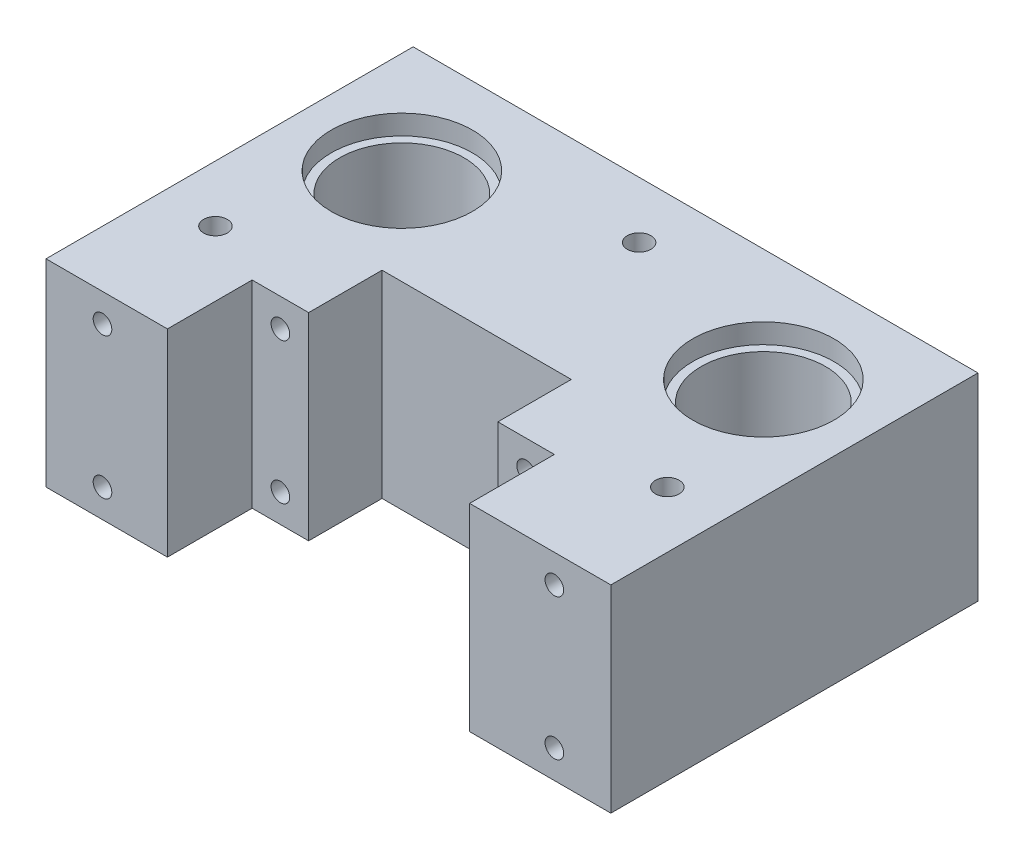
from build123d import *

# Parameters (mm, degrees)
SKETCH_1_W          = 100
SKETCH_1_H          = 35
EXTRUDE_1_DEPTH     = 65
SKETCH_2_OUTSIDE_W  = 126.86
SKETCH_2_OUTSIDE_H  = 91.86
SKETCH_2_OUTSIDE_R  = 11
CUT_EXTRUDE_1_DEPTH = 65
SKETCH_3_R          = 12.5
CUT_EXTRUDE_2_DEPTH = 3.5
SKETCH_4_R          = 2.1
CUT_EXTRUDE_3_DEPTH = 15
SKETCH_5_R          = 1.65
CUT_EXTRUDE_4_DEPTH = 15
SKETCH_6_R          = 1.65
CUT_EXTRUDE_5_DEPTH = 15
SKETCH_8_R          = 1.65
CUT_EXTRUDE_6_DEPTH = 15


with BuildPart() as part:
    # Sketch 1 → Extrude 1 (new body)
    with BuildSketch(Plane.XY):
        with Locations((50, 17.5)):
            Rectangle(SKETCH_1_W, SKETCH_1_H)
    extrude(amount=EXTRUDE_1_DEPTH)

    # Sketch 2 outside → Cut-Extrude 1 (cut)
    # profile 1 of 3: a face of its own
    with BuildSketch(Plane(origin=(0, 35, 0), x_dir=(1, 0, 0), z_dir=(0, 1, 0))):
        with Locations((50, -32.5)):
            Rectangle(SKETCH_2_OUTSIDE_W, SKETCH_2_OUTSIDE_H)
        Polygon((0, 0), (100, 0), (100, -65), (74.9975, -65), (74.9975, -50), (64.9975, -50), (64.9975, -37), (31.4975, -37), (31.4975, -50), (21.4975, -50), (21.4975, -65), (0, -65), align=None, mode=Mode.SUBTRACT)
    # profile 2 of 3: a face of its own
    with BuildSketch(Plane(origin=(0, 35, 0), x_dir=(1, 0, 0), z_dir=(0, 1, 0))):
        with Locations(Location((18, -20, 0), (0, 0, 270))):
            Circle(SKETCH_2_OUTSIDE_R)
    # profile 3 of 3: a face of its own
    with BuildSketch(Plane(origin=(0, 35, 0), x_dir=(1, 0, 0), z_dir=(0, 1, 0))):
        with Locations(Location((82, -20, 0), (0, 0, 270))):
            Circle(SKETCH_2_OUTSIDE_R)
    extrude(amount=-CUT_EXTRUDE_1_DEPTH, mode=Mode.SUBTRACT)

    # Sketch 3 → Cut-Extrude 2 (cut)
    with BuildSketch(Plane(origin=(0, 35, 0), x_dir=(1, 0, 0), z_dir=(0, 1, 0))):
        with Locations(Location((18, -20, 0), (0, 0, 270))):
            Circle(SKETCH_3_R)
        with Locations(Location((82, -20, 0), (0, 0, 270))):
            Circle(SKETCH_3_R)
    extrude(amount=-CUT_EXTRUDE_2_DEPTH, mode=Mode.SUBTRACT)

    # Sketch 4 → Cut-Extrude 3 (cut)
    with BuildSketch(Plane(origin=(0, 35, 0), x_dir=(1, 0, 0), z_dir=(0, 1, 0))):
        with Locations(Location((50, -10, 0), (0, 0, 270))):
            Circle(SKETCH_4_R)
        with Locations(Location((10, -45, 0), (0, 0, 270))):
            Circle(SKETCH_4_R)
        with Locations(Location((90, -45, 0), (0, 0, 270))):
            Circle(SKETCH_4_R)
    extrude(amount=-CUT_EXTRUDE_3_DEPTH, mode=Mode.SUBTRACT)

    # Sketch 5 → Cut-Extrude 4 (cut)
    with BuildSketch(Plane.XY.offset(50)):
        with Locations((26.4975, 30)):
            Circle(SKETCH_5_R)
        with Locations((69.9975, 30)):
            Circle(SKETCH_5_R)
        with Locations((69.9975, 5)):
            Circle(SKETCH_5_R)
        with Locations((26.4975, 5)):
            Circle(SKETCH_5_R)
    extrude(amount=-CUT_EXTRUDE_4_DEPTH, mode=Mode.SUBTRACT)

    # Sketch 6 → Cut-Extrude 5 (cut)
    with BuildSketch(Plane.XY.offset(65)):
        with Locations((90, 30)):
            Circle(SKETCH_6_R)
        with Locations((90, 5)):
            Circle(SKETCH_6_R)
        with Locations((10, 5)):
            Circle(SKETCH_6_R)
        with Locations((10, 30)):
            Circle(SKETCH_6_R)
    extrude(amount=-CUT_EXTRUDE_5_DEPTH, mode=Mode.SUBTRACT)

    # Sketch 8 → Cut-Extrude 6 (cut)
    with BuildSketch(Plane.XZ):
        with Locations(Location((36.4975, 32.5, 0), (0, 0, 270))):
            Circle(SKETCH_8_R)
        with Locations(Location((59.9975, 32.5, 0), (0, 0, 270))):
            Circle(SKETCH_8_R)
    extrude(amount=-CUT_EXTRUDE_6_DEPTH, mode=Mode.SUBTRACT)


solid = part.part
